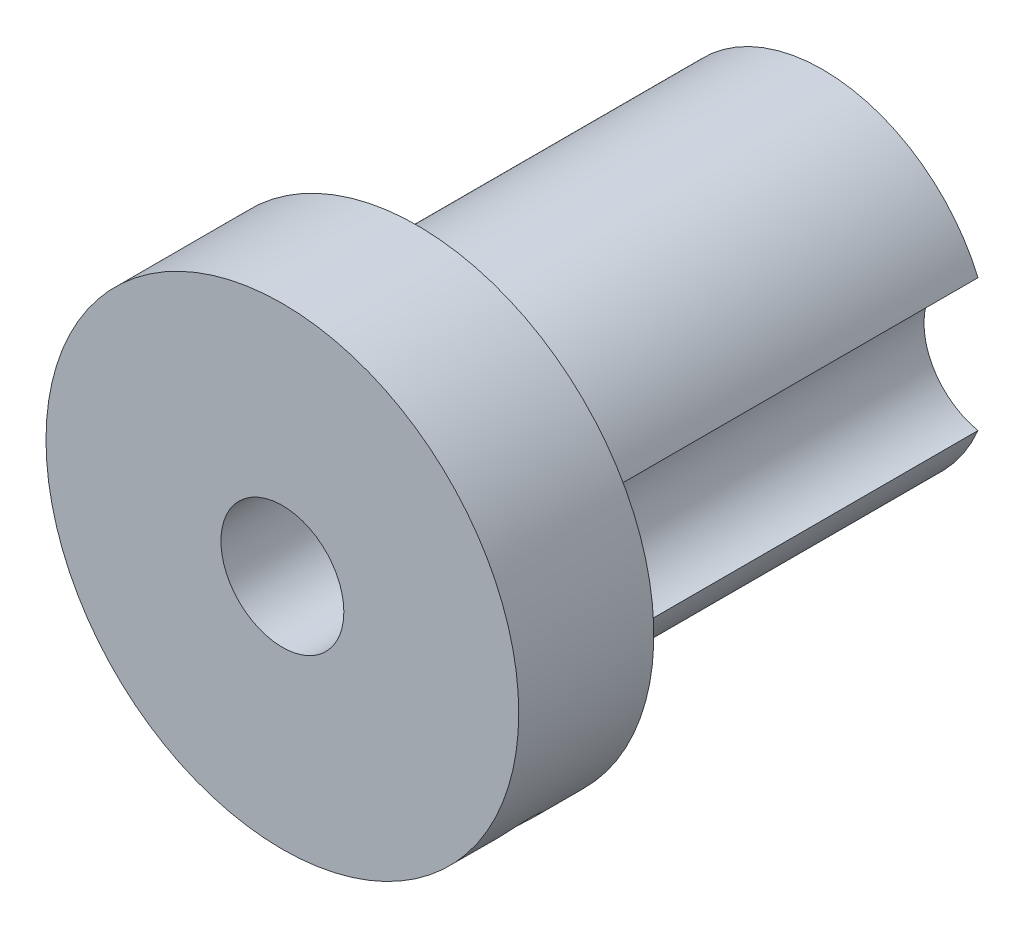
ISO-10303-21;
HEADER;
FILE_DESCRIPTION(('STEP AP214'),'2;1');
FILE_NAME('part.step','',(''),(''),'','','');
FILE_SCHEMA(('AUTOMOTIVE_DESIGN { 1 0 10303 214 1 1 1 1 }'));
ENDSEC;
DATA;
#1=APPLICATION_CONTEXT('core data for automotive mechanical design processes');
#2=APPLICATION_PROTOCOL_DEFINITION('international standard','automotive_design',2000,#1);
#3=PRODUCT_CONTEXT('',#1,'mechanical');
#4=PRODUCT('Part','Part','',(#3));
#5=PRODUCT_RELATED_PRODUCT_CATEGORY('part','',(#4));
#6=PRODUCT_DEFINITION_FORMATION('','',#4);
#7=PRODUCT_DEFINITION_CONTEXT('part definition',#1,'design');
#8=PRODUCT_DEFINITION('design','',#6,#7);
#9=PRODUCT_DEFINITION_SHAPE('','',#8);
#10=(LENGTH_UNIT() NAMED_UNIT(*) SI_UNIT(.MILLI.,.METRE.));
#11=(NAMED_UNIT(*) PLANE_ANGLE_UNIT() SI_UNIT($,.RADIAN.));
#12=(NAMED_UNIT(*) SI_UNIT($,.STERADIAN.) SOLID_ANGLE_UNIT());
#13=UNCERTAINTY_MEASURE_WITH_UNIT(LENGTH_MEASURE(1.E-05),#10,'distance_accuracy_value','');
#14=(GEOMETRIC_REPRESENTATION_CONTEXT(3) GLOBAL_UNCERTAINTY_ASSIGNED_CONTEXT((#13)) GLOBAL_UNIT_ASSIGNED_CONTEXT((#10,
#11,#12)) REPRESENTATION_CONTEXT('',''));
#15=CARTESIAN_POINT('',(0.,0.,0.));
#16=DIRECTION('',(0.,0.,1.));
#17=DIRECTION('',(1.,0.,0.));
#18=AXIS2_PLACEMENT_3D('',#15,#16,#17);
#19=CARTESIAN_POINT('',(0.,0.,0.));
#20=DIRECTION('',(0.,0.,1.));
#21=DIRECTION('',(1.,0.,0.));
#22=AXIS2_PLACEMENT_3D('',#19,#20,#21);
#23=PLANE('',#22);
#24=CARTESIAN_POINT('',(0.,0.,0.));
#25=DIRECTION('',(0.,0.,1.));
#26=DIRECTION('',(1.,0.,0.));
#27=AXIS2_PLACEMENT_3D('',#24,#25,#26);
#28=CIRCLE('',#27,9.1);
#29=CARTESIAN_POINT('',(9.1,0.,0.));
#30=VERTEX_POINT('',#29);
#31=EDGE_CURVE('E103',#30,#30,#28,.T.);
#32=ORIENTED_EDGE('',*,*,#31,.T.);
#33=EDGE_LOOP('',(#32));
#34=FACE_BOUND('',#33,.T.);
#35=CARTESIAN_POINT('',(-25.,0.,0.));
#36=DIRECTION('',(0.,0.,-1.));
#37=DIRECTION('',(-1.,0.,0.));
#38=AXIS2_PLACEMENT_3D('',#35,#36,#37);
#39=CIRCLE('',#38,10.);
#40=CARTESIAN_POINT('',(-22.9999999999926,9.79795897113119,0.));
#41=VERTEX_POINT('',#40);
#42=CARTESIAN_POINT('',(-22.9999999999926,-9.79795897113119,0.));
#43=VERTEX_POINT('',#42);
#44=EDGE_CURVE('E77',#41,#43,#39,.T.);
#45=ORIENTED_EDGE('',*,*,#44,.F.);
#46=CARTESIAN_POINT('',(0.,0.,0.));
#47=DIRECTION('',(0.,0.,-1.));
#48=DIRECTION('',(-1.,0.,0.));
#49=AXIS2_PLACEMENT_3D('',#46,#47,#48);
#50=CIRCLE('',#49,25.);
#51=CARTESIAN_POINT('',(22.9999999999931,9.79795897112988,0.));
#52=VERTEX_POINT('',#51);
#53=EDGE_CURVE('E85',#41,#52,#50,.T.);
#54=ORIENTED_EDGE('',*,*,#53,.T.);
#55=CARTESIAN_POINT('',(25.000000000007,0.,0.));
#56=DIRECTION('',(0.,0.,-1.));
#57=DIRECTION('',(-1.,0.,0.));
#58=AXIS2_PLACEMENT_3D('',#55,#56,#57);
#59=CIRCLE('',#58,10.);
#60=CARTESIAN_POINT('',(22.9999999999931,-9.79795897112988,0.));
#61=VERTEX_POINT('',#60);
#62=EDGE_CURVE('E126',#61,#52,#59,.T.);
#63=ORIENTED_EDGE('',*,*,#62,.F.);
#64=EDGE_CURVE('E88',#61,#43,#50,.T.);
#65=ORIENTED_EDGE('',*,*,#64,.T.);
#66=EDGE_LOOP('',(#45,#54,#63,#65));
#67=FACE_BOUND('',#66,.T.);
#68=ADVANCED_FACE('F33',(#34,#67),#23,.F.);
#69=CARTESIAN_POINT('',(0.,0.,60.));
#70=DIRECTION('',(0.,0.,-1.));
#71=DIRECTION('',(-1.,0.,0.));
#72=AXIS2_PLACEMENT_3D('',#69,#70,#71);
#73=CYLINDRICAL_SURFACE('',#72,25.);
#74=ORIENTED_EDGE('',*,*,#53,.F.);
#75=DIRECTION('',(0.,0.,1.));
#76=VECTOR('',#75,1.);
#77=CARTESIAN_POINT('',(-22.9999999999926,9.79795897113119,0.));
#78=LINE('',#77,#76);
#79=CARTESIAN_POINT('',(-22.9999999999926,9.79795897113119,60.));
#80=VERTEX_POINT('',#79);
#81=EDGE_CURVE('E74',#41,#80,#78,.T.);
#82=ORIENTED_EDGE('',*,*,#81,.T.);
#83=CARTESIAN_POINT('',(0.,0.,60.));
#84=DIRECTION('',(0.,0.,-1.));
#85=DIRECTION('',(-1.,0.,0.));
#86=AXIS2_PLACEMENT_3D('',#83,#84,#85);
#87=CIRCLE('',#86,25.);
#88=CARTESIAN_POINT('',(23.,9.7979589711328,60.));
#89=VERTEX_POINT('',#88);
#90=EDGE_CURVE('E57',#80,#89,#87,.T.);
#91=ORIENTED_EDGE('',*,*,#90,.T.);
#92=DIRECTION('',(0.,0.,1.));
#93=VECTOR('',#92,1.);
#94=CARTESIAN_POINT('',(22.9999999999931,9.79795897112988,0.));
#95=LINE('',#94,#93);
#96=EDGE_CURVE('E91',#52,#89,#95,.T.);
#97=ORIENTED_EDGE('',*,*,#96,.F.);
#98=EDGE_LOOP('',(#74,#82,#91,#97));
#99=FACE_BOUND('',#98,.T.);
#100=ADVANCED_FACE('F90',(#99),#73,.T.);
#101=CARTESIAN_POINT('',(22.9999999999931,-9.79795897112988,60.));
#102=VERTEX_POINT('',#101);
#103=CARTESIAN_POINT('',(-23.,-9.79795897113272,60.));
#104=VERTEX_POINT('',#103);
#105=EDGE_CURVE('E99',#102,#104,#87,.T.);
#106=ORIENTED_EDGE('',*,*,#105,.T.);
#107=DIRECTION('',(0.,0.,1.));
#108=VECTOR('',#107,1.);
#109=CARTESIAN_POINT('',(-22.9999999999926,-9.79795897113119,0.));
#110=LINE('',#109,#108);
#111=EDGE_CURVE('E49',#43,#104,#110,.T.);
#112=ORIENTED_EDGE('',*,*,#111,.F.);
#113=ORIENTED_EDGE('',*,*,#64,.F.);
#114=DIRECTION('',(0.,0.,1.));
#115=VECTOR('',#114,1.);
#116=CARTESIAN_POINT('',(22.9999999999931,-9.79795897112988,0.));
#117=LINE('',#116,#115);
#118=EDGE_CURVE('E115',#61,#102,#117,.T.);
#119=ORIENTED_EDGE('',*,*,#118,.T.);
#120=EDGE_LOOP('',(#106,#112,#113,#119));
#121=FACE_BOUND('',#120,.T.);
#122=ADVANCED_FACE('F114',(#121),#73,.T.);
#123=CARTESIAN_POINT('',(0.,0.,80.));
#124=DIRECTION('',(0.,0.,-1.));
#125=DIRECTION('',(-1.,0.,0.));
#126=AXIS2_PLACEMENT_3D('',#123,#124,#125);
#127=CYLINDRICAL_SURFACE('',#126,35.);
#128=CARTESIAN_POINT('',(26.7789763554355,-22.5363356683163,70.));
#129=CARTESIAN_POINT('',(26.7789723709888,-22.5363420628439,70.1681788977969));
#130=CARTESIAN_POINT('',(26.7698123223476,-22.5472388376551,70.3364718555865));
#131=CARTESIAN_POINT('',(26.7333347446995,-22.5904754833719,70.668400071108));
#132=CARTESIAN_POINT('',(26.7059967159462,-22.6228395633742,70.8320298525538));
#133=CARTESIAN_POINT('',(26.6337469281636,-22.7078536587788,71.1497763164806));
#134=CARTESIAN_POINT('',(26.5888452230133,-22.760492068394,71.3038983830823));
#135=CARTESIAN_POINT('',(26.4824351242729,-22.8842141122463,71.5983417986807));
#136=CARTESIAN_POINT('',(26.4209302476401,-22.9552938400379,71.7386660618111));
#137=CARTESIAN_POINT('',(26.2824769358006,-23.1136856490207,72.0019468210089));
#138=CARTESIAN_POINT('',(26.2054917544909,-23.2010363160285,72.1248607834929));
#139=CARTESIAN_POINT('',(26.0378977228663,-23.3889653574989,72.3494663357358));
#140=CARTESIAN_POINT('',(25.9472882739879,-23.4895443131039,72.4511569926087));
#141=CARTESIAN_POINT('',(25.7544262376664,-23.7008436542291,72.6305716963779));
#142=CARTESIAN_POINT('',(25.6521560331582,-23.8115793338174,72.7082588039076));
#143=CARTESIAN_POINT('',(25.4386235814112,-24.0395673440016,72.8372248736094));
#144=CARTESIAN_POINT('',(25.3273614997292,-24.1568195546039,72.8885043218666));
#145=CARTESIAN_POINT('',(25.0990448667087,-24.3939532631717,72.9630766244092));
#146=CARTESIAN_POINT('',(24.9820053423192,-24.5138275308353,72.9864384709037));
#147=CARTESIAN_POINT('',(24.7450990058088,-24.7529472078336,73.0047257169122));
#148=CARTESIAN_POINT('',(24.6252322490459,-24.8721926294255,72.9996516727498));
#149=CARTESIAN_POINT('',(24.3864342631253,-25.1063682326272,72.9612675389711));
#150=CARTESIAN_POINT('',(24.2675014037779,-25.2213089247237,72.9280316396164));
#151=CARTESIAN_POINT('',(24.0337858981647,-25.4441195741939,72.834382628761));
#152=CARTESIAN_POINT('',(23.9190032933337,-25.5519894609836,72.7739692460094));
#153=CARTESIAN_POINT('',(23.6969628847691,-25.7580462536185,72.627597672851));
#154=CARTESIAN_POINT('',(23.5897150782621,-25.8562203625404,72.5416063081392));
#155=CARTESIAN_POINT('',(23.3862939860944,-26.0403553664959,72.3465438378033));
#156=CARTESIAN_POINT('',(23.2901209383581,-26.1263159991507,72.2374722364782));
#157=CARTESIAN_POINT('',(23.1116819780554,-26.2843001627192,71.9989274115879));
#158=CARTESIAN_POINT('',(23.0294617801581,-26.3562779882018,71.8693897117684));
#159=CARTESIAN_POINT('',(22.8820640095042,-26.4843484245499,71.593814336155));
#160=CARTESIAN_POINT('',(22.816886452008,-26.5404410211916,71.4477766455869));
#161=CARTESIAN_POINT('',(22.7058102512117,-26.6355317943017,71.1433008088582));
#162=CARTESIAN_POINT('',(22.6599141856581,-26.6745276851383,70.9848610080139));
#163=CARTESIAN_POINT('',(22.5890335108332,-26.734579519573,70.6601005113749));
#164=CARTESIAN_POINT('',(22.5640484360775,-26.7556358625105,70.4937799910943));
#165=CARTESIAN_POINT('',(22.5359290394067,-26.7793249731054,70.1585451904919));
#166=CARTESIAN_POINT('',(22.5327255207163,-26.7820160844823,69.9896408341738));
#167=CARTESIAN_POINT('',(22.5481004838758,-26.7690728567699,69.6535358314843));
#168=CARTESIAN_POINT('',(22.566678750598,-26.7534386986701,69.4863351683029));
#169=CARTESIAN_POINT('',(22.6249077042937,-26.7042128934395,69.1586431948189));
#170=CARTESIAN_POINT('',(22.6645261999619,-26.6706486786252,68.9981420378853));
#171=CARTESIAN_POINT('',(22.7634235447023,-26.5862887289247,68.6880999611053));
#172=CARTESIAN_POINT('',(22.8227027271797,-26.5354927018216,68.538559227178));
#173=CARTESIAN_POINT('',(22.9590555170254,-26.4176055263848,68.2542704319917));
#174=CARTESIAN_POINT('',(23.0361734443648,-26.3504737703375,68.1195604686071));
#175=CARTESIAN_POINT('',(23.2055262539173,-26.2014549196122,67.8691423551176));
#176=CARTESIAN_POINT('',(23.2977614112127,-26.1195675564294,67.7534345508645));
#177=CARTESIAN_POINT('',(23.4945862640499,-25.9426663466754,67.5439970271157));
#178=CARTESIAN_POINT('',(23.5992078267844,-25.8476185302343,67.450325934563));
#179=CARTESIAN_POINT('',(23.8172531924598,-25.6468396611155,67.2880232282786));
#180=CARTESIAN_POINT('',(23.930676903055,-25.5411087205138,67.2193913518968));
#181=CARTESIAN_POINT('',(24.1626298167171,-25.3217839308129,67.1092157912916));
#182=CARTESIAN_POINT('',(24.2811519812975,-25.2082007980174,67.067635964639));
#183=CARTESIAN_POINT('',(24.5198582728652,-24.9760736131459,67.0126266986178));
#184=CARTESIAN_POINT('',(24.6400423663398,-24.8575296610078,66.9991966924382));
#185=CARTESIAN_POINT('',(24.8781834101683,-24.6191852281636,67.0008750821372));
#186=CARTESIAN_POINT('',(24.9961462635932,-24.4993899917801,67.0158921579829));
#187=CARTESIAN_POINT('',(25.22696562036,-24.2616501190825,67.0738478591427));
#188=CARTESIAN_POINT('',(25.3398221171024,-24.1437054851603,67.1167865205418));
#189=CARTESIAN_POINT('',(25.5574419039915,-23.9132244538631,67.2293430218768));
#190=CARTESIAN_POINT('',(25.6622057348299,-23.8006876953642,67.298959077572));
#191=CARTESIAN_POINT('',(25.8610296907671,-23.5845020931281,67.4628838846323));
#192=CARTESIAN_POINT('',(25.9550899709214,-23.4808531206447,67.5571922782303));
#193=CARTESIAN_POINT('',(26.1305509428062,-23.285438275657,67.7681675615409));
#194=CARTESIAN_POINT('',(26.2119119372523,-23.1937098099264,67.8849021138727));
#195=CARTESIAN_POINT('',(26.3597926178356,-23.0255056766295,68.1372917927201));
#196=CARTESIAN_POINT('',(26.4263087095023,-22.9490337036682,68.2729514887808));
#197=CARTESIAN_POINT('',(26.5431259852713,-22.8138222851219,68.5596186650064));
#198=CARTESIAN_POINT('',(26.5933951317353,-22.7551178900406,68.7106557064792));
#199=CARTESIAN_POINT('',(26.6764120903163,-22.6577397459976,69.0234732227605));
#200=CARTESIAN_POINT('',(26.7091799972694,-22.6190430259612,69.1852411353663));
#201=CARTESIAN_POINT('',(26.7482006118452,-22.572866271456,69.4566320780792));
#202=CARTESIAN_POINT('',(26.7597296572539,-22.5591891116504,69.564510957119));
#203=CARTESIAN_POINT('',(26.7751188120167,-22.5409217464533,69.781577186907));
#204=CARTESIAN_POINT('',(26.7789789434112,-22.5363315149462,69.890764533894));
#205=CARTESIAN_POINT('',(26.7789763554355,-22.5363356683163,70.));
#206=B_SPLINE_CURVE_WITH_KNOTS('',3,(#128,#129,#130,#131,#132,#133,#134,#135,#136,#137,#138,
#139,#140,#141,#142,#143,#144,#145,#146,#147,#148,#149,#150,#151,#152,#153,#154,#155,#156,#157,
#158,#159,#160,#161,#162,#163,#164,#165,#166,#167,#168,#169,#170,#171,#172,#173,#174,#175,#176,
#177,#178,#179,#180,#181,#182,#183,#184,#185,#186,#187,#188,#189,#190,#191,#192,#193,#194,#195,
#196,#197,#198,#199,#200,#201,#202,#203,#204,#205),.UNSPECIFIED.,.T.,.F.,(4,2,2,2,2,2,2,2,2,2,2,
2,2,2,2,2,2,2,2,2,2,2,2,2,2,2,2,2,2,2,2,2,2,2,2,2,2,2,4),(0.,0.5041378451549,1.0088451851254,
1.51326404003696,2.0175761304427,2.52309976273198,3.02864561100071,3.5349656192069,
4.04127630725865,4.54633315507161,5.05138012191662,5.55510070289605,6.05882631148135,
6.56320811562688,7.06760075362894,7.57361533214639,8.07963036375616,8.58571302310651,
9.09178441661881,9.59624734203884,10.100705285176,10.6043936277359,11.1080905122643,
11.6130525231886,12.1180237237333,12.6243235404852,13.1306180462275,13.6362347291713,
14.1418412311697,14.6458273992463,15.1498142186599,15.653767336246,16.1577131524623,
16.6632040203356,17.1688171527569,17.6754213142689,18.1814425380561,18.5088908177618,
18.836338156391),.UNSPECIFIED.);
#207=CARTESIAN_POINT('',(26.7789763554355,-22.5363356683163,70.));
#208=VERTEX_POINT('',#207);
#209=EDGE_CURVE('E122',#208,#208,#206,.T.);
#210=ORIENTED_EDGE('',*,*,#209,.F.);
#211=EDGE_LOOP('',(#210));
#212=FACE_BOUND('',#211,.T.);
#213=CARTESIAN_POINT('',(0.,0.,80.));
#214=DIRECTION('',(0.,0.,1.));
#215=DIRECTION('',(1.,0.,0.));
#216=AXIS2_PLACEMENT_3D('',#213,#214,#215);
#217=CIRCLE('',#216,35.);
#218=CARTESIAN_POINT('',(35.,0.,80.));
#219=VERTEX_POINT('',#218);
#220=EDGE_CURVE('E12',#219,#219,#217,.T.);
#221=ORIENTED_EDGE('',*,*,#220,.F.);
#222=EDGE_LOOP('',(#221));
#223=FACE_BOUND('',#222,.T.);
#224=CARTESIAN_POINT('',(0.,0.,60.));
#225=DIRECTION('',(0.,0.,-1.));
#226=DIRECTION('',(-1.,0.,0.));
#227=AXIS2_PLACEMENT_3D('',#224,#225,#226);
#228=CIRCLE('',#227,35.);
#229=CARTESIAN_POINT('',(-35.,0.,60.));
#230=VERTEX_POINT('',#229);
#231=EDGE_CURVE('E37',#230,#230,#228,.T.);
#232=ORIENTED_EDGE('',*,*,#231,.F.);
#233=EDGE_LOOP('',(#232));
#234=FACE_BOUND('',#233,.T.);
#235=ADVANCED_FACE('F35',(#212,#223,#234),#127,.T.);
#236=CARTESIAN_POINT('',(0.,0.,80.));
#237=DIRECTION('',(0.,0.,1.));
#238=DIRECTION('',(1.,0.,0.));
#239=AXIS2_PLACEMENT_3D('',#236,#237,#238);
#240=PLANE('',#239);
#241=ORIENTED_EDGE('',*,*,#220,.T.);
#242=EDGE_LOOP('',(#241));
#243=FACE_BOUND('',#242,.T.);
#244=CARTESIAN_POINT('',(0.,0.,80.));
#245=DIRECTION('',(0.,0.,1.));
#246=DIRECTION('',(1.,0.,0.));
#247=AXIS2_PLACEMENT_3D('',#244,#245,#246);
#248=CIRCLE('',#247,9.1);
#249=CARTESIAN_POINT('',(9.1,0.,80.));
#250=VERTEX_POINT('',#249);
#251=EDGE_CURVE('E42',#250,#250,#248,.T.);
#252=ORIENTED_EDGE('',*,*,#251,.F.);
#253=EDGE_LOOP('',(#252));
#254=FACE_BOUND('',#253,.T.);
#255=ADVANCED_FACE('F164',(#243,#254),#240,.T.);
#256=CARTESIAN_POINT('',(0.,0.,80.));
#257=DIRECTION('',(0.,0.,-1.));
#258=DIRECTION('',(-1.,0.,0.));
#259=AXIS2_PLACEMENT_3D('',#256,#257,#258);
#260=CYLINDRICAL_SURFACE('',#259,9.1);
#261=CARTESIAN_POINT('',(8.19626890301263,-3.95362821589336,70.));
#262=CARTESIAN_POINT('',(8.19626903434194,-3.95362776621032,70.1635181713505));
#263=CARTESIAN_POINT('',(8.1901206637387,-3.96645070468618,70.3270345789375));
#264=CARTESIAN_POINT('',(8.16547420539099,-4.01693933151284,70.6492303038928));
#265=CARTESIAN_POINT('',(8.14697385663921,-4.05460956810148,70.8079087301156));
#266=CARTESIAN_POINT('',(8.09751190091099,-4.15250214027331,71.1157100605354));
#267=CARTESIAN_POINT('',(8.06657427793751,-4.21268105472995,71.2648507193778));
#268=CARTESIAN_POINT('',(7.99198423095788,-4.35252172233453,71.550253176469));
#269=CARTESIAN_POINT('',(7.94832909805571,-4.4321876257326,71.6865122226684));
#270=CARTESIAN_POINT('',(7.8462711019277,-4.61052297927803,71.9474972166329));
#271=CARTESIAN_POINT('',(7.78740872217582,-4.70975631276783,72.0716582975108));
#272=CARTESIAN_POINT('',(7.65555666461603,-4.92117407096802,72.2998545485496));
#273=CARTESIAN_POINT('',(7.5825647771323,-5.03336052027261,72.4038865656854));
#274=CARTESIAN_POINT('',(7.42056500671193,-5.26936280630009,72.5914219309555));
#275=CARTESIAN_POINT('',(7.3311967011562,-5.39340199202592,72.6743352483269));
#276=CARTESIAN_POINT('',(7.13868299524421,-5.64573663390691,72.8133790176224));
#277=CARTESIAN_POINT('',(7.0355412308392,-5.7740309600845,72.8695165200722));
#278=CARTESIAN_POINT('',(6.82116564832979,-6.02561766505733,72.9515048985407));
#279=CARTESIAN_POINT('',(6.71032757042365,-6.14893146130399,72.9783230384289));
#280=CARTESIAN_POINT('',(6.48046605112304,-6.39072418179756,73.0039850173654));
#281=CARTESIAN_POINT('',(6.36144468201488,-6.50920431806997,73.0028359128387));
#282=CARTESIAN_POINT('',(6.12359624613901,-6.73329512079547,72.9732136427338));
#283=CARTESIAN_POINT('',(6.00493699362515,-6.83922517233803,72.9457907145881));
#284=CARTESIAN_POINT('',(5.76724843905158,-7.04081986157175,72.866133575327));
#285=CARTESIAN_POINT('',(5.64821911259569,-7.13648380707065,72.8138976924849));
#286=CARTESIAN_POINT('',(5.41219717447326,-7.31713843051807,72.6854732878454));
#287=CARTESIAN_POINT('',(5.2952511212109,-7.40197427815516,72.6089823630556));
#288=CARTESIAN_POINT('',(5.06900213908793,-7.55871602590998,72.4344671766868));
#289=CARTESIAN_POINT('',(4.95970131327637,-7.63061837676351,72.336437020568));
#290=CARTESIAN_POINT('',(4.7478519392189,-7.76429776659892,72.1163156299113));
#291=CARTESIAN_POINT('',(4.64584719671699,-7.82545498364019,71.9933233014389));
#292=CARTESIAN_POINT('',(4.45874006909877,-7.93355801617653,71.7294859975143));
#293=CARTESIAN_POINT('',(4.37364017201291,-7.98050174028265,71.5886383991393));
#294=CARTESIAN_POINT('',(4.22338994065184,-8.06104043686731,71.2905324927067));
#295=CARTESIAN_POINT('',(4.15852833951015,-8.09444408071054,71.1330761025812));
#296=CARTESIAN_POINT('',(4.05409198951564,-8.14725740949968,70.8077814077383));
#297=CARTESIAN_POINT('',(4.01450692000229,-8.16667280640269,70.6399473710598));
#298=CARTESIAN_POINT('',(3.96429587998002,-8.1911603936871,70.3066162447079));
#299=CARTESIAN_POINT('',(3.95246626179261,-8.1968291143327,70.1413442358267));
#300=CARTESIAN_POINT('',(3.9549702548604,-8.19562182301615,69.8110622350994));
#301=CARTESIAN_POINT('',(3.96929924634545,-8.18874802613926,69.6460522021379));
#302=CARTESIAN_POINT('',(4.0222893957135,-8.16284254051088,69.3267122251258));
#303=CARTESIAN_POINT('',(4.06012328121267,-8.14422389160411,69.1722096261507));
#304=CARTESIAN_POINT('',(4.15727184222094,-8.09506234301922,68.8721238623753));
#305=CARTESIAN_POINT('',(4.21659027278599,-8.06451735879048,68.7265422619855));
#306=CARTESIAN_POINT('',(4.35596122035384,-7.99011951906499,68.4434005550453));
#307=CARTESIAN_POINT('',(4.43660268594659,-7.94588133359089,68.3062322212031));
#308=CARTESIAN_POINT('',(4.61404146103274,-7.84417378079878,68.0481992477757));
#309=CARTESIAN_POINT('',(4.71084343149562,-7.78670059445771,67.9273393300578));
#310=CARTESIAN_POINT('',(4.92161035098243,-7.65531558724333,67.6994982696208));
#311=CARTESIAN_POINT('',(5.03616726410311,-7.58075928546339,67.5934337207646));
#312=CARTESIAN_POINT('',(5.27421185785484,-7.41710997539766,67.4051946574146));
#313=CARTESIAN_POINT('',(5.39769920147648,-7.32801751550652,67.3230192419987));
#314=CARTESIAN_POINT('',(5.64801083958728,-7.13684650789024,67.1856517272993));
#315=CARTESIAN_POINT('',(5.77480666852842,-7.03486056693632,67.1302796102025));
#316=CARTESIAN_POINT('',(6.0277639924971,-6.81935633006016,67.0477470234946));
#317=CARTESIAN_POINT('',(6.15392569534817,-6.70584211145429,67.0205766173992));
#318=CARTESIAN_POINT('',(6.39540742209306,-6.47574725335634,66.9960976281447));
#319=CARTESIAN_POINT('',(6.5109591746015,-6.35954839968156,66.9974718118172));
#320=CARTESIAN_POINT('',(6.73400573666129,-6.12287542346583,67.0268051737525));
#321=CARTESIAN_POINT('',(6.84150117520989,-6.00240163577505,67.0547622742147));
#322=CARTESIAN_POINT('',(7.044311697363,-5.76298003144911,67.1355999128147));
#323=CARTESIAN_POINT('',(7.13978752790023,-5.64403696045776,67.1880938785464));
#324=CARTESIAN_POINT('',(7.31891426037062,-5.40973807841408,67.3161589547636));
#325=CARTESIAN_POINT('',(7.40256303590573,-5.29438291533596,67.3917342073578));
#326=CARTESIAN_POINT('',(7.56008057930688,-5.06705142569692,67.5669891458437));
#327=CARTESIAN_POINT('',(7.63348196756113,-4.95535134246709,67.6674467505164));
#328=CARTESIAN_POINT('',(7.76655342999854,-4.74407697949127,67.8882828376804));
#329=CARTESIAN_POINT('',(7.82621915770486,-4.64450654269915,68.0086676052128));
#330=CARTESIAN_POINT('',(7.93398228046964,-4.45802433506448,68.2714197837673));
#331=CARTESIAN_POINT('',(7.98155317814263,-4.37173830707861,68.4144492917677));
#332=CARTESIAN_POINT('',(8.0623727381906,-4.22084228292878,68.7152325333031));
#333=CARTESIAN_POINT('',(8.09562552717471,-4.15622604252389,68.8729820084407));
#334=CARTESIAN_POINT('',(8.14674888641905,-4.05506378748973,69.1902883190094));
#335=CARTESIAN_POINT('',(8.16533471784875,-4.01722335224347,69.3493164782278));
#336=CARTESIAN_POINT('',(8.19009264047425,-3.96650985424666,69.6722314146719));
#337=CARTESIAN_POINT('',(8.19626877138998,-3.95362866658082,69.8361165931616));
#338=CARTESIAN_POINT('',(8.19626890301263,-3.95362821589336,70.));
#339=B_SPLINE_CURVE_WITH_KNOTS('',3,(#261,#262,#263,#264,#265,#266,#267,#268,#269,#270,#271,
#272,#273,#274,#275,#276,#277,#278,#279,#280,#281,#282,#283,#284,#285,#286,#287,#288,#289,#290,
#291,#292,#293,#294,#295,#296,#297,#298,#299,#300,#301,#302,#303,#304,#305,#306,#307,#308,#309,
#310,#311,#312,#313,#314,#315,#316,#317,#318,#319,#320,#321,#322,#323,#324,#325,#326,#327,#328,
#329,#330,#331,#332,#333,#334,#335,#336,#337,#338),.UNSPECIFIED.,.T.,.F.,(4,2,2,2,2,2,2,2,2,2,2,
2,2,2,2,2,2,2,2,2,2,2,2,2,2,2,2,2,2,2,2,2,2,2,2,2,2,2,4),(0.,0.489947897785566,
0.979985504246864,1.46908262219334,1.95828399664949,2.46447464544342,2.97074452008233,
3.48990277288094,4.00892424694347,4.51025165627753,5.01145257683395,5.49342019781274,
5.97542029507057,6.46368312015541,6.95207973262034,7.46299835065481,7.97399210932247,
8.49197390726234,9.00974407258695,9.50460865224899,9.99938584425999,10.4776650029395,
10.9560277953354,11.4493095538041,11.9427338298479,12.4592964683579,12.9758396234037,
13.4888636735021,14.0017069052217,14.4909390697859,14.9801329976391,15.4618669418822,
15.9436873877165,16.4430629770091,16.9425963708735,17.4611350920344,17.9795242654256,
18.4707264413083,18.9617686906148),.UNSPECIFIED.);
#340=CARTESIAN_POINT('',(8.19626890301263,-3.95362821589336,70.));
#341=VERTEX_POINT('',#340);
#342=EDGE_CURVE('E119',#341,#341,#339,.T.);
#343=ORIENTED_EDGE('',*,*,#342,.T.);
#344=EDGE_LOOP('',(#343));
#345=FACE_BOUND('',#344,.T.);
#346=ORIENTED_EDGE('',*,*,#251,.T.);
#347=EDGE_LOOP('',(#346));
#348=FACE_BOUND('',#347,.T.);
#349=ORIENTED_EDGE('',*,*,#31,.F.);
#350=EDGE_LOOP('',(#349));
#351=FACE_BOUND('',#350,.T.);
#352=ADVANCED_FACE('F154',(#345,#348,#351),#260,.F.);
#353=CARTESIAN_POINT('',(0.,0.,60.));
#354=DIRECTION('',(0.,0.,-1.));
#355=DIRECTION('',(-1.,0.,0.));
#356=AXIS2_PLACEMENT_3D('',#353,#354,#355);
#357=PLANE('',#356);
#358=CARTESIAN_POINT('',(30.,0.,60.));
#359=DIRECTION('',(0.,0.,-1.));
#360=DIRECTION('',(-1.,0.,0.));
#361=AXIS2_PLACEMENT_3D('',#358,#359,#360);
#362=CIRCLE('',#361,1.65);
#363=CARTESIAN_POINT('',(28.35,0.,60.));
#364=VERTEX_POINT('',#363);
#365=EDGE_CURVE('E131',#364,#364,#362,.T.);
#366=ORIENTED_EDGE('',*,*,#365,.F.);
#367=EDGE_LOOP('',(#366));
#368=FACE_BOUND('',#367,.T.);
#369=CARTESIAN_POINT('',(0.,-30.,60.));
#370=DIRECTION('',(0.,0.,-1.));
#371=DIRECTION('',(-1.,0.,0.));
#372=AXIS2_PLACEMENT_3D('',#369,#370,#371);
#373=CIRCLE('',#372,1.65);
#374=CARTESIAN_POINT('',(-1.65,-30.,60.));
#375=VERTEX_POINT('',#374);
#376=EDGE_CURVE('E135',#375,#375,#373,.T.);
#377=ORIENTED_EDGE('',*,*,#376,.F.);
#378=EDGE_LOOP('',(#377));
#379=FACE_BOUND('',#378,.T.);
#380=CARTESIAN_POINT('',(-29.9999999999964,0.,60.));
#381=DIRECTION('',(0.,0.,-1.));
#382=DIRECTION('',(-1.,0.,0.));
#383=AXIS2_PLACEMENT_3D('',#380,#381,#382);
#384=CIRCLE('',#383,1.65);
#385=CARTESIAN_POINT('',(-31.6499999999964,0.,60.));
#386=VERTEX_POINT('',#385);
#387=EDGE_CURVE('E141',#386,#386,#384,.T.);
#388=ORIENTED_EDGE('',*,*,#387,.F.);
#389=EDGE_LOOP('',(#388));
#390=FACE_BOUND('',#389,.T.);
#391=CARTESIAN_POINT('',(0.,30.,60.));
#392=DIRECTION('',(0.,0.,-1.));
#393=DIRECTION('',(-1.,0.,0.));
#394=AXIS2_PLACEMENT_3D('',#391,#392,#393);
#395=CIRCLE('',#394,1.65);
#396=CARTESIAN_POINT('',(-1.65,30.,60.));
#397=VERTEX_POINT('',#396);
#398=EDGE_CURVE('E95',#397,#397,#395,.T.);
#399=ORIENTED_EDGE('',*,*,#398,.F.);
#400=EDGE_LOOP('',(#399));
#401=FACE_BOUND('',#400,.T.);
#402=ORIENTED_EDGE('',*,*,#105,.F.);
#403=CARTESIAN_POINT('',(25.000000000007,0.,60.));
#404=DIRECTION('',(0.,0.,-1.));
#405=DIRECTION('',(-1.,0.,0.));
#406=AXIS2_PLACEMENT_3D('',#403,#404,#405);
#407=CIRCLE('',#406,10.);
#408=EDGE_CURVE('E80',#102,#89,#407,.T.);
#409=ORIENTED_EDGE('',*,*,#408,.T.);
#410=ORIENTED_EDGE('',*,*,#90,.F.);
#411=CARTESIAN_POINT('',(-25.,0.,60.));
#412=DIRECTION('',(0.,0.,-1.));
#413=DIRECTION('',(-1.,0.,0.));
#414=AXIS2_PLACEMENT_3D('',#411,#412,#413);
#415=CIRCLE('',#414,10.);
#416=EDGE_CURVE('E78',#80,#104,#415,.T.);
#417=ORIENTED_EDGE('',*,*,#416,.T.);
#418=EDGE_LOOP('',(#402,#409,#410,#417));
#419=FACE_BOUND('',#418,.T.);
#420=ORIENTED_EDGE('',*,*,#231,.T.);
#421=EDGE_LOOP('',(#420));
#422=FACE_BOUND('',#421,.T.);
#423=ADVANCED_FACE('F118',(#368,#379,#390,#401,#419,#422),#357,.T.);
#424=CARTESIAN_POINT('',(0.,30.,75.));
#425=DIRECTION('',(0.,0.,-1.));
#426=DIRECTION('',(-1.,0.,0.));
#427=AXIS2_PLACEMENT_3D('',#424,#425,#426);
#428=CYLINDRICAL_SURFACE('',#427,1.65);
#429=CARTESIAN_POINT('',(0.,30.,75.));
#430=DIRECTION('',(0.,0.,-1.));
#431=DIRECTION('',(-1.,0.,0.));
#432=AXIS2_PLACEMENT_3D('',#429,#430,#431);
#433=CIRCLE('',#432,1.65);
#434=CARTESIAN_POINT('',(-1.65,30.,75.));
#435=VERTEX_POINT('',#434);
#436=EDGE_CURVE('E92',#435,#435,#433,.T.);
#437=ORIENTED_EDGE('',*,*,#436,.F.);
#438=EDGE_LOOP('',(#437));
#439=FACE_BOUND('',#438,.T.);
#440=ORIENTED_EDGE('',*,*,#398,.T.);
#441=EDGE_LOOP('',(#440));
#442=FACE_BOUND('',#441,.T.);
#443=ADVANCED_FACE('F151',(#439,#442),#428,.F.);
#444=CARTESIAN_POINT('',(0.,30.,75.));
#445=DIRECTION('',(0.,0.,-1.));
#446=DIRECTION('',(-1.,0.,0.));
#447=AXIS2_PLACEMENT_3D('',#444,#445,#446);
#448=PLANE('',#447);
#449=ORIENTED_EDGE('',*,*,#436,.T.);
#450=EDGE_LOOP('',(#449));
#451=FACE_BOUND('',#450,.T.);
#452=ADVANCED_FACE('F161',(#451),#448,.T.);
#453=CARTESIAN_POINT('',(-29.9999999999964,0.,75.));
#454=DIRECTION('',(0.,0.,-1.));
#455=DIRECTION('',(-1.,0.,0.));
#456=AXIS2_PLACEMENT_3D('',#453,#454,#455);
#457=CYLINDRICAL_SURFACE('',#456,1.65);
#458=CARTESIAN_POINT('',(-29.9999999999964,0.,75.));
#459=DIRECTION('',(0.,0.,-1.));
#460=DIRECTION('',(-1.,0.,0.));
#461=AXIS2_PLACEMENT_3D('',#458,#459,#460);
#462=CIRCLE('',#461,1.65);
#463=CARTESIAN_POINT('',(-31.6499999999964,0.,75.));
#464=VERTEX_POINT('',#463);
#465=EDGE_CURVE('E144',#464,#464,#462,.T.);
#466=ORIENTED_EDGE('',*,*,#465,.F.);
#467=EDGE_LOOP('',(#466));
#468=FACE_BOUND('',#467,.T.);
#469=ORIENTED_EDGE('',*,*,#387,.T.);
#470=EDGE_LOOP('',(#469));
#471=FACE_BOUND('',#470,.T.);
#472=ADVANCED_FACE('F235',(#468,#471),#457,.F.);
#473=CARTESIAN_POINT('',(-29.9999999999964,0.,75.));
#474=DIRECTION('',(0.,0.,-1.));
#475=DIRECTION('',(-1.,0.,0.));
#476=AXIS2_PLACEMENT_3D('',#473,#474,#475);
#477=PLANE('',#476);
#478=ORIENTED_EDGE('',*,*,#465,.T.);
#479=EDGE_LOOP('',(#478));
#480=FACE_BOUND('',#479,.T.);
#481=ADVANCED_FACE('F231',(#480),#477,.T.);
#482=CARTESIAN_POINT('',(0.,-30.,75.));
#483=DIRECTION('',(0.,0.,-1.));
#484=DIRECTION('',(-1.,0.,0.));
#485=AXIS2_PLACEMENT_3D('',#482,#483,#484);
#486=CYLINDRICAL_SURFACE('',#485,1.65);
#487=CARTESIAN_POINT('',(0.,-30.,75.));
#488=DIRECTION('',(0.,0.,-1.));
#489=DIRECTION('',(-1.,0.,0.));
#490=AXIS2_PLACEMENT_3D('',#487,#488,#489);
#491=CIRCLE('',#490,1.65);
#492=CARTESIAN_POINT('',(-1.65,-30.,75.));
#493=VERTEX_POINT('',#492);
#494=EDGE_CURVE('E138',#493,#493,#491,.T.);
#495=ORIENTED_EDGE('',*,*,#494,.F.);
#496=EDGE_LOOP('',(#495));
#497=FACE_BOUND('',#496,.T.);
#498=ORIENTED_EDGE('',*,*,#376,.T.);
#499=EDGE_LOOP('',(#498));
#500=FACE_BOUND('',#499,.T.);
#501=ADVANCED_FACE('F227',(#497,#500),#486,.F.);
#502=CARTESIAN_POINT('',(0.,-30.,75.));
#503=DIRECTION('',(0.,0.,-1.));
#504=DIRECTION('',(-1.,0.,0.));
#505=AXIS2_PLACEMENT_3D('',#502,#503,#504);
#506=PLANE('',#505);
#507=ORIENTED_EDGE('',*,*,#494,.T.);
#508=EDGE_LOOP('',(#507));
#509=FACE_BOUND('',#508,.T.);
#510=ADVANCED_FACE('F223',(#509),#506,.T.);
#511=CARTESIAN_POINT('',(30.,0.,75.));
#512=DIRECTION('',(0.,0.,-1.));
#513=DIRECTION('',(-1.,0.,0.));
#514=AXIS2_PLACEMENT_3D('',#511,#512,#513);
#515=CYLINDRICAL_SURFACE('',#514,1.65);
#516=CARTESIAN_POINT('',(30.,0.,75.));
#517=DIRECTION('',(0.,0.,-1.));
#518=DIRECTION('',(-1.,0.,0.));
#519=AXIS2_PLACEMENT_3D('',#516,#517,#518);
#520=CIRCLE('',#519,1.65);
#521=CARTESIAN_POINT('',(28.35,0.,75.));
#522=VERTEX_POINT('',#521);
#523=EDGE_CURVE('E132',#522,#522,#520,.T.);
#524=ORIENTED_EDGE('',*,*,#523,.F.);
#525=EDGE_LOOP('',(#524));
#526=FACE_BOUND('',#525,.T.);
#527=ORIENTED_EDGE('',*,*,#365,.T.);
#528=EDGE_LOOP('',(#527));
#529=FACE_BOUND('',#528,.T.);
#530=ADVANCED_FACE('F219',(#526,#529),#515,.F.);
#531=CARTESIAN_POINT('',(30.,0.,75.));
#532=DIRECTION('',(0.,0.,-1.));
#533=DIRECTION('',(-1.,0.,0.));
#534=AXIS2_PLACEMENT_3D('',#531,#532,#533);
#535=PLANE('',#534);
#536=ORIENTED_EDGE('',*,*,#523,.T.);
#537=EDGE_LOOP('',(#536));
#538=FACE_BOUND('',#537,.T.);
#539=ADVANCED_FACE('F215',(#538),#535,.T.);
#540=CARTESIAN_POINT('',(25.000000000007,0.,0.));
#541=DIRECTION('',(0.,0.,1.));
#542=DIRECTION('',(1.,0.,0.));
#543=AXIS2_PLACEMENT_3D('',#540,#541,#542);
#544=CYLINDRICAL_SURFACE('',#543,10.);
#545=ORIENTED_EDGE('',*,*,#408,.F.);
#546=ORIENTED_EDGE('',*,*,#118,.F.);
#547=ORIENTED_EDGE('',*,*,#62,.T.);
#548=ORIENTED_EDGE('',*,*,#96,.T.);
#549=EDGE_LOOP('',(#545,#546,#547,#548));
#550=FACE_BOUND('',#549,.T.);
#551=ADVANCED_FACE('F212',(#550),#544,.F.);
#552=CARTESIAN_POINT('',(-25.,0.,0.));
#553=DIRECTION('',(0.,0.,1.));
#554=DIRECTION('',(1.,0.,0.));
#555=AXIS2_PLACEMENT_3D('',#552,#553,#554);
#556=CYLINDRICAL_SURFACE('',#555,10.);
#557=ORIENTED_EDGE('',*,*,#416,.F.);
#558=ORIENTED_EDGE('',*,*,#81,.F.);
#559=ORIENTED_EDGE('',*,*,#44,.T.);
#560=ORIENTED_EDGE('',*,*,#111,.T.);
#561=EDGE_LOOP('',(#557,#558,#559,#560));
#562=FACE_BOUND('',#561,.T.);
#563=ADVANCED_FACE('F76',(#562),#556,.F.);
#564=CARTESIAN_POINT('',(-35.0009999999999,35.0010000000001,70.));
#565=DIRECTION('',(0.707106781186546,-0.707106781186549,0.));
#566=DIRECTION('',(0.707106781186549,0.707106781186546,0.));
#567=AXIS2_PLACEMENT_3D('',#564,#565,#566);
#568=CYLINDRICAL_SURFACE('',#567,3.00000000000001);
#569=ORIENTED_EDGE('',*,*,#342,.F.);
#570=EDGE_LOOP('',(#569));
#571=FACE_BOUND('',#570,.T.);
#572=ORIENTED_EDGE('',*,*,#209,.T.);
#573=EDGE_LOOP('',(#572));
#574=FACE_BOUND('',#573,.T.);
#575=ADVANCED_FACE('F202',(#571,#574),#568,.F.);
#576=CLOSED_SHELL('',(#68,#100,#122,#235,#255,#352,#423,#443,#452,#472,#481,#501,#510,#530,#539,
#551,#563,#575));
#577=MANIFOLD_SOLID_BREP('B2',#576);
#578=ADVANCED_BREP_SHAPE_REPRESENTATION('',(#18,#577),#14);
#579=SHAPE_DEFINITION_REPRESENTATION(#9,#578);
ENDSEC;
END-ISO-10303-21;
